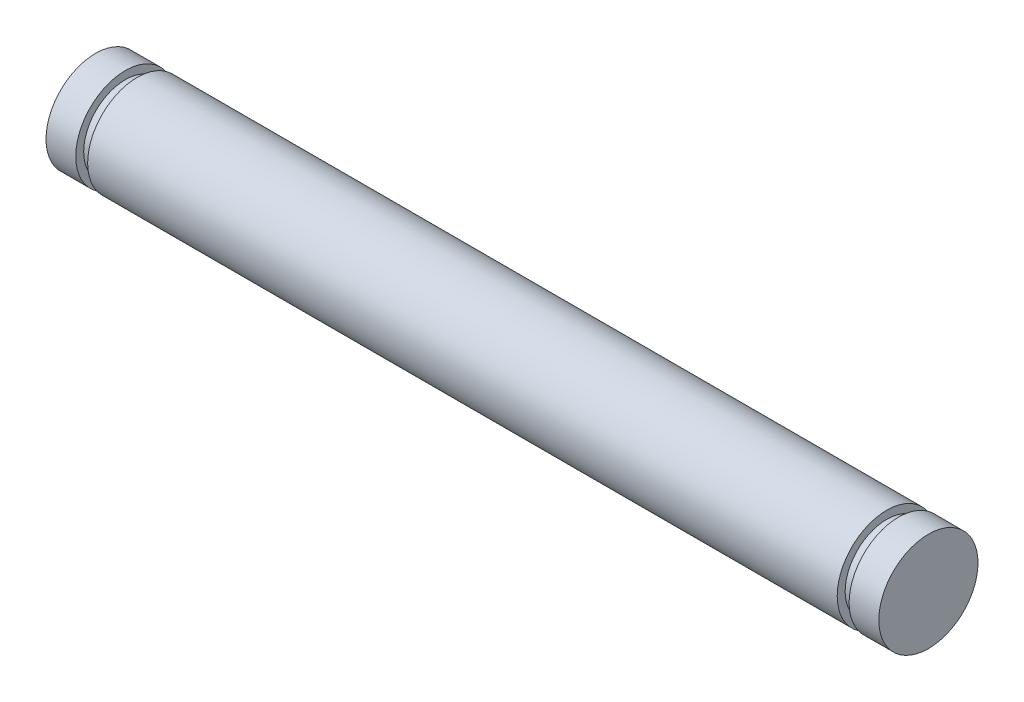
from build123d import *

# Parameters (mm, degrees)
SKETCH1_R           = 3.175
BOSS_EXTRUDE1_DEPTH = 26.67
SKETCH2_W           = 0.762
SKETCH2_H           = 0.508


with BuildPart() as part:
    # Sketch1 → Boss-Extrude1 (new, symmetric)
    with BuildSketch(Plane(origin=(0, 0, 0), x_dir=(0, 0, -1), z_dir=(1, 0, 0))):
        Circle(SKETCH1_R)
    extrude(amount=BOSS_EXTRUDE1_DEPTH, both=True)

    # Sketch2 → Cut-Revolve1 (revolve, cut)
    with BuildSketch(Plane.XY, mode=Mode.PRIVATE) as cut_revolve1_sk:
        with Locations((-24.384, 2.921)):
            Rectangle(SKETCH2_W, SKETCH2_H)
        with Locations((24.384, 2.921)):
            Rectangle(SKETCH2_W, SKETCH2_H)
    revolve(cut_revolve1_sk.sketch.rotate(Axis((-26.67, 0, 0), (1, 0, 0)), 90), axis=Axis((-26.67, 0, 0), (1, 0, 0)), mode=Mode.SUBTRACT)


solid = part.part
